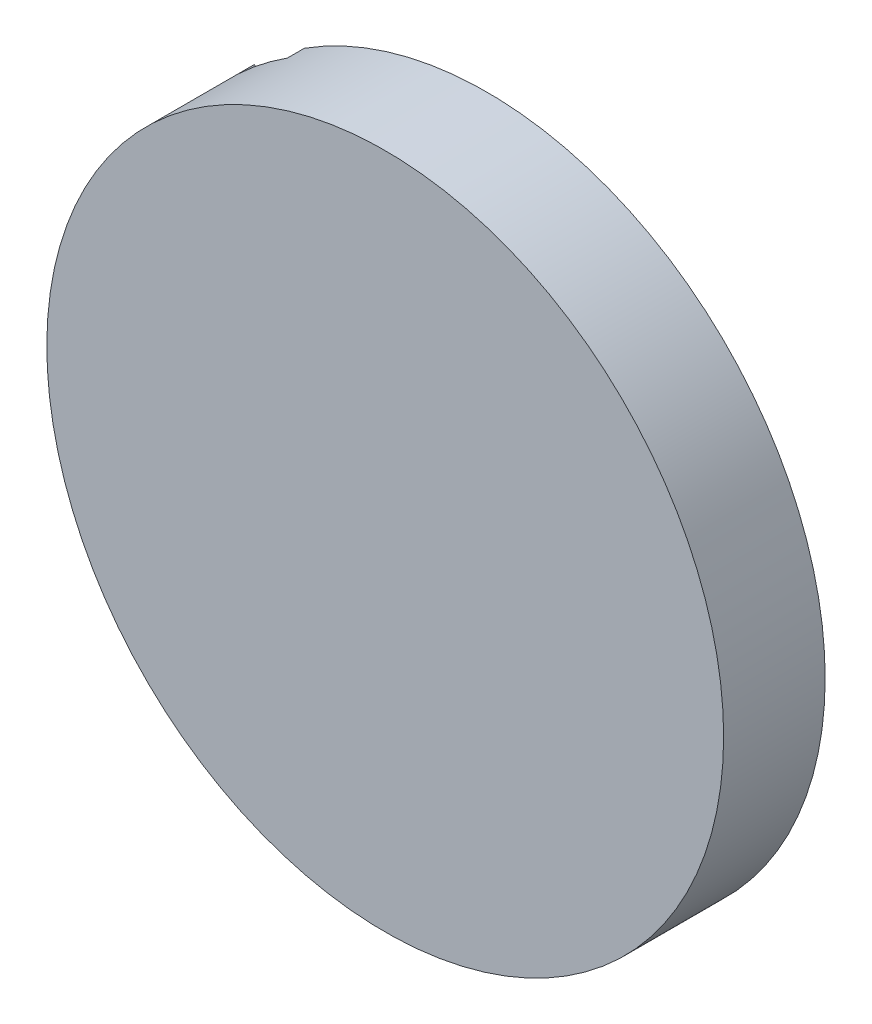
ISO-10303-21;
HEADER;
FILE_DESCRIPTION(('STEP AP214'),'2;1');
FILE_NAME('part.step','',(''),(''),'','','');
FILE_SCHEMA(('AUTOMOTIVE_DESIGN { 1 0 10303 214 1 1 1 1 }'));
ENDSEC;
DATA;
#1=APPLICATION_CONTEXT('core data for automotive mechanical design processes');
#2=APPLICATION_PROTOCOL_DEFINITION('international standard','automotive_design',2000,#1);
#3=PRODUCT_CONTEXT('',#1,'mechanical');
#4=PRODUCT('Part','Part','',(#3));
#5=PRODUCT_RELATED_PRODUCT_CATEGORY('part','',(#4));
#6=PRODUCT_DEFINITION_FORMATION('','',#4);
#7=PRODUCT_DEFINITION_CONTEXT('part definition',#1,'design');
#8=PRODUCT_DEFINITION('design','',#6,#7);
#9=PRODUCT_DEFINITION_SHAPE('','',#8);
#10=(LENGTH_UNIT() NAMED_UNIT(*) SI_UNIT(.MILLI.,.METRE.));
#11=(NAMED_UNIT(*) PLANE_ANGLE_UNIT() SI_UNIT($,.RADIAN.));
#12=(NAMED_UNIT(*) SI_UNIT($,.STERADIAN.) SOLID_ANGLE_UNIT());
#13=UNCERTAINTY_MEASURE_WITH_UNIT(LENGTH_MEASURE(1.E-05),#10,'distance_accuracy_value','');
#14=(GEOMETRIC_REPRESENTATION_CONTEXT(3) GLOBAL_UNCERTAINTY_ASSIGNED_CONTEXT((#13)) GLOBAL_UNIT_ASSIGNED_CONTEXT((#10,
#11,#12)) REPRESENTATION_CONTEXT('',''));
#15=CARTESIAN_POINT('',(0.,0.,0.));
#16=DIRECTION('',(0.,0.,1.));
#17=DIRECTION('',(1.,0.,0.));
#18=AXIS2_PLACEMENT_3D('',#15,#16,#17);
#19=CARTESIAN_POINT('',(0.,0.,6.));
#20=DIRECTION('',(0.,0.,-1.));
#21=DIRECTION('',(-1.,0.,0.));
#22=AXIS2_PLACEMENT_3D('',#19,#20,#21);
#23=CYLINDRICAL_SURFACE('',#22,20.);
#24=CARTESIAN_POINT('',(0.,0.,6.));
#25=DIRECTION('',(0.,0.,1.));
#26=DIRECTION('',(1.,0.,0.));
#27=AXIS2_PLACEMENT_3D('',#24,#25,#26);
#28=CIRCLE('',#27,20.);
#29=CARTESIAN_POINT('',(20.,0.,6.));
#30=VERTEX_POINT('',#29);
#31=EDGE_CURVE('E11',#30,#30,#28,.T.);
#32=ORIENTED_EDGE('',*,*,#31,.F.);
#33=EDGE_LOOP('',(#32));
#34=FACE_BOUND('',#33,.T.);
#35=CARTESIAN_POINT('',(0.,0.,1.));
#36=DIRECTION('',(0.,0.,-1.));
#37=DIRECTION('',(-1.,0.,0.));
#38=AXIS2_PLACEMENT_3D('',#35,#36,#37);
#39=CIRCLE('',#38,20.);
#40=CARTESIAN_POINT('',(-13.7334496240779,14.5393384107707,1.));
#41=VERTEX_POINT('',#40);
#42=CARTESIAN_POINT('',(-10.7842508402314,16.8433943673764,1.));
#43=VERTEX_POINT('',#42);
#44=EDGE_CURVE('E76',#41,#43,#39,.T.);
#45=ORIENTED_EDGE('',*,*,#44,.F.);
#46=DIRECTION('',(0.,0.,-1.));
#47=VECTOR('',#46,1.);
#48=CARTESIAN_POINT('',(-13.7334496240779,14.5393384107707,1.));
#49=LINE('',#48,#47);
#50=CARTESIAN_POINT('',(-13.7334496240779,14.5393384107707,0.));
#51=VERTEX_POINT('',#50);
#52=EDGE_CURVE('E67',#41,#51,#49,.T.);
#53=ORIENTED_EDGE('',*,*,#52,.T.);
#54=CARTESIAN_POINT('',(0.,0.,0.));
#55=DIRECTION('',(0.,0.,1.));
#56=DIRECTION('',(1.,0.,0.));
#57=AXIS2_PLACEMENT_3D('',#54,#55,#56);
#58=CIRCLE('',#57,20.);
#59=CARTESIAN_POINT('',(-10.7842508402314,16.8433943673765,0.));
#60=VERTEX_POINT('',#59);
#61=EDGE_CURVE('E38',#51,#60,#58,.T.);
#62=ORIENTED_EDGE('',*,*,#61,.T.);
#63=DIRECTION('',(0.,0.,-1.));
#64=VECTOR('',#63,1.);
#65=CARTESIAN_POINT('',(-10.7842508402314,16.8433943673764,1.));
#66=LINE('',#65,#64);
#67=EDGE_CURVE('E45',#43,#60,#66,.T.);
#68=ORIENTED_EDGE('',*,*,#67,.F.);
#69=EDGE_LOOP('',(#45,#53,#62,#68));
#70=FACE_BOUND('',#69,.T.);
#71=ADVANCED_FACE('F31',(#34,#70),#23,.T.);
#72=CARTESIAN_POINT('',(0.,0.,6.));
#73=DIRECTION('',(0.,0.,1.));
#74=DIRECTION('',(1.,0.,0.));
#75=AXIS2_PLACEMENT_3D('',#72,#73,#74);
#76=PLANE('',#75);
#77=ORIENTED_EDGE('',*,*,#31,.T.);
#78=EDGE_LOOP('',(#77));
#79=FACE_BOUND('',#78,.T.);
#80=ADVANCED_FACE('F100',(#79),#76,.T.);
#81=CARTESIAN_POINT('',(0.,0.,0.));
#82=DIRECTION('',(0.,0.,1.));
#83=DIRECTION('',(1.,0.,0.));
#84=AXIS2_PLACEMENT_3D('',#81,#82,#83);
#85=PLANE('',#84);
#86=ORIENTED_EDGE('',*,*,#61,.F.);
#87=DIRECTION('',(-0.686672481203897,0.726966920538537,0.));
#88=VECTOR('',#87,1.);
#89=CARTESIAN_POINT('',(0.,0.,0.));
#90=LINE('',#89,#88);
#91=CARTESIAN_POINT('',(0.,0.,0.));
#92=VERTEX_POINT('',#91);
#93=EDGE_CURVE('E64',#92,#51,#90,.T.);
#94=ORIENTED_EDGE('',*,*,#93,.F.);
#95=DIRECTION('',(0.539212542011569,-0.842169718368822,0.));
#96=VECTOR('',#95,1.);
#97=CARTESIAN_POINT('',(0.,0.,0.));
#98=LINE('',#97,#96);
#99=EDGE_CURVE('E71',#60,#92,#98,.T.);
#100=ORIENTED_EDGE('',*,*,#99,.F.);
#101=EDGE_LOOP('',(#86,#94,#100));
#102=FACE_BOUND('',#101,.T.);
#103=ADVANCED_FACE('F79',(#102),#85,.F.);
#104=CARTESIAN_POINT('',(0.,0.,1.));
#105=DIRECTION('',(-0.726966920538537,-0.686672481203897,0.));
#106=DIRECTION('',(0.686672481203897,-0.726966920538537,0.));
#107=AXIS2_PLACEMENT_3D('',#104,#105,#106);
#108=PLANE('',#107);
#109=ORIENTED_EDGE('',*,*,#93,.T.);
#110=ORIENTED_EDGE('',*,*,#52,.F.);
#111=DIRECTION('',(-0.686672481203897,0.726966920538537,0.));
#112=VECTOR('',#111,1.);
#113=CARTESIAN_POINT('',(0.,0.,1.));
#114=LINE('',#113,#112);
#115=CARTESIAN_POINT('',(0.,0.,1.));
#116=VERTEX_POINT('',#115);
#117=EDGE_CURVE('E86',#116,#41,#114,.T.);
#118=ORIENTED_EDGE('',*,*,#117,.F.);
#119=DIRECTION('',(0.,0.,-1.));
#120=VECTOR('',#119,1.);
#121=CARTESIAN_POINT('',(0.,0.,1.));
#122=LINE('',#121,#120);
#123=EDGE_CURVE('E50',#116,#92,#122,.T.);
#124=ORIENTED_EDGE('',*,*,#123,.T.);
#125=EDGE_LOOP('',(#109,#110,#118,#124));
#126=FACE_BOUND('',#125,.T.);
#127=ADVANCED_FACE('F66',(#126),#108,.F.);
#128=CARTESIAN_POINT('',(0.,0.,1.));
#129=DIRECTION('',(0.842169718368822,0.539212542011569,0.));
#130=DIRECTION('',(-0.539212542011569,0.842169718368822,0.));
#131=AXIS2_PLACEMENT_3D('',#128,#129,#130);
#132=PLANE('',#131);
#133=ORIENTED_EDGE('',*,*,#99,.T.);
#134=ORIENTED_EDGE('',*,*,#123,.F.);
#135=DIRECTION('',(0.539212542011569,-0.842169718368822,0.));
#136=VECTOR('',#135,1.);
#137=CARTESIAN_POINT('',(0.,0.,1.));
#138=LINE('',#137,#136);
#139=EDGE_CURVE('E77',#43,#116,#138,.T.);
#140=ORIENTED_EDGE('',*,*,#139,.F.);
#141=ORIENTED_EDGE('',*,*,#67,.T.);
#142=EDGE_LOOP('',(#133,#134,#140,#141));
#143=FACE_BOUND('',#142,.T.);
#144=ADVANCED_FACE('F88',(#143),#132,.F.);
#145=CARTESIAN_POINT('',(0.,0.,1.));
#146=DIRECTION('',(0.,0.,-1.));
#147=DIRECTION('',(-1.,0.,0.));
#148=AXIS2_PLACEMENT_3D('',#145,#146,#147);
#149=PLANE('',#148);
#150=ORIENTED_EDGE('',*,*,#117,.T.);
#151=ORIENTED_EDGE('',*,*,#44,.T.);
#152=ORIENTED_EDGE('',*,*,#139,.T.);
#153=EDGE_LOOP('',(#150,#151,#152));
#154=FACE_BOUND('',#153,.T.);
#155=ADVANCED_FACE('F90',(#154),#149,.T.);
#156=CLOSED_SHELL('',(#71,#80,#103,#127,#144,#155));
#157=MANIFOLD_SOLID_BREP('B2',#156);
#158=ADVANCED_BREP_SHAPE_REPRESENTATION('',(#18,#157),#14);
#159=SHAPE_DEFINITION_REPRESENTATION(#9,#158);
ENDSEC;
END-ISO-10303-21;
